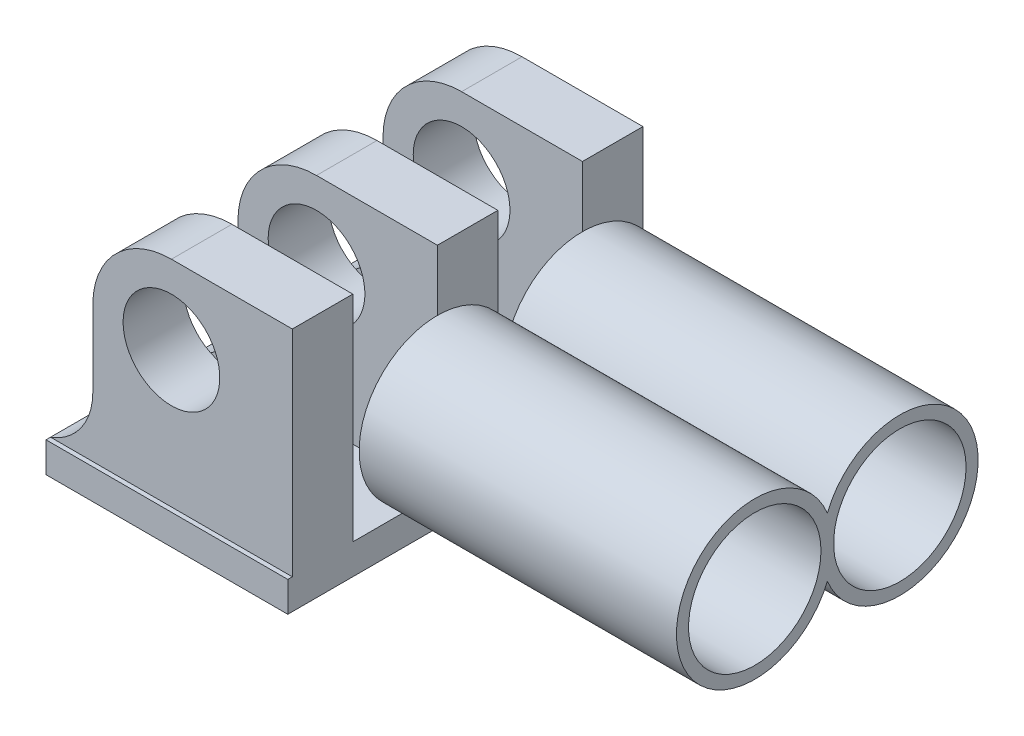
ISO-10303-21;
HEADER;
FILE_DESCRIPTION(('STEP AP214'),'2;1');
FILE_NAME('part.step','',(''),(''),'','','');
FILE_SCHEMA(('AUTOMOTIVE_DESIGN { 1 0 10303 214 1 1 1 1 }'));
ENDSEC;
DATA;
#1=APPLICATION_CONTEXT('core data for automotive mechanical design processes');
#2=APPLICATION_PROTOCOL_DEFINITION('international standard','automotive_design',2000,#1);
#3=PRODUCT_CONTEXT('',#1,'mechanical');
#4=PRODUCT('Part','Part','',(#3));
#5=PRODUCT_RELATED_PRODUCT_CATEGORY('part','',(#4));
#6=PRODUCT_DEFINITION_FORMATION('','',#4);
#7=PRODUCT_DEFINITION_CONTEXT('part definition',#1,'design');
#8=PRODUCT_DEFINITION('design','',#6,#7);
#9=PRODUCT_DEFINITION_SHAPE('','',#8);
#10=(LENGTH_UNIT() NAMED_UNIT(*) SI_UNIT(.MILLI.,.METRE.));
#11=(NAMED_UNIT(*) PLANE_ANGLE_UNIT() SI_UNIT($,.RADIAN.));
#12=(NAMED_UNIT(*) SI_UNIT($,.STERADIAN.) SOLID_ANGLE_UNIT());
#13=UNCERTAINTY_MEASURE_WITH_UNIT(LENGTH_MEASURE(1.E-05),#10,'distance_accuracy_value','');
#14=(GEOMETRIC_REPRESENTATION_CONTEXT(3) GLOBAL_UNCERTAINTY_ASSIGNED_CONTEXT((#13)) GLOBAL_UNIT_ASSIGNED_CONTEXT((#10,
#11,#12)) REPRESENTATION_CONTEXT('',''));
#15=CARTESIAN_POINT('',(0.,0.,0.));
#16=DIRECTION('',(0.,0.,1.));
#17=DIRECTION('',(1.,0.,0.));
#18=AXIS2_PLACEMENT_3D('',#15,#16,#17);
#19=CARTESIAN_POINT('',(209.55,57.15,38.735));
#20=DIRECTION('',(-1.,0.,0.));
#21=DIRECTION('',(0.,0.,1.));
#22=AXIS2_PLACEMENT_3D('',#19,#20,#21);
#23=CYLINDRICAL_SURFACE('',#22,27.8210988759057);
#24=CARTESIAN_POINT('',(209.55,57.15,38.735));
#25=DIRECTION('',(1.,0.,0.));
#26=DIRECTION('',(0.,0.,-1.));
#27=AXIS2_PLACEMENT_3D('',#24,#25,#26);
#28=CIRCLE('',#27,27.8210988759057);
#29=CARTESIAN_POINT('',(209.55,57.15,10.9139011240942));
#30=VERTEX_POINT('',#29);
#31=EDGE_CURVE('E142',#30,#30,#28,.T.);
#32=ORIENTED_EDGE('',*,*,#31,.T.);
#33=EDGE_LOOP('',(#32));
#34=FACE_BOUND('',#33,.T.);
#35=CARTESIAN_POINT('',(76.2,57.15,38.735));
#36=DIRECTION('',(1.,0.,0.));
#37=DIRECTION('',(0.,0.,-1.));
#38=AXIS2_PLACEMENT_3D('',#35,#36,#37);
#39=CIRCLE('',#38,27.8210988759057);
#40=CARTESIAN_POINT('',(76.2,57.15,10.9139011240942));
#41=VERTEX_POINT('',#40);
#42=EDGE_CURVE('E150',#41,#41,#39,.T.);
#43=ORIENTED_EDGE('',*,*,#42,.F.);
#44=EDGE_LOOP('',(#43));
#45=FACE_BOUND('',#44,.T.);
#46=ADVANCED_FACE('F112',(#34,#45),#23,.F.);
#47=CARTESIAN_POINT('',(209.55,57.15,38.735));
#48=DIRECTION('',(-1.,0.,0.));
#49=DIRECTION('',(0.,0.,1.));
#50=AXIS2_PLACEMENT_3D('',#47,#48,#49);
#51=CYLINDRICAL_SURFACE('',#50,32.9010988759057);
#52=CARTESIAN_POINT('',(76.2,57.15,38.735));
#53=DIRECTION('',(1.,0.,0.));
#54=DIRECTION('',(0.,0.,-1.));
#55=AXIS2_PLACEMENT_3D('',#52,#53,#54);
#56=CIRCLE('',#55,32.9010988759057);
#57=CARTESIAN_POINT('',(76.2,69.5375706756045,8.2550000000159));
#58=VERTEX_POINT('',#57);
#59=CARTESIAN_POINT('',(76.2,44.7624293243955,8.2550000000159));
#60=VERTEX_POINT('',#59);
#61=EDGE_CURVE('E147',#58,#60,#56,.T.);
#62=ORIENTED_EDGE('',*,*,#61,.T.);
#63=DIRECTION('',(-1.,0.,0.));
#64=VECTOR('',#63,1.);
#65=CARTESIAN_POINT('',(209.55,44.7624293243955,8.2550000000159));
#66=LINE('',#65,#64);
#67=CARTESIAN_POINT('',(209.55,44.7624293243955,8.2550000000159));
#68=VERTEX_POINT('',#67);
#69=EDGE_CURVE('E122',#68,#60,#66,.T.);
#70=ORIENTED_EDGE('',*,*,#69,.F.);
#71=CARTESIAN_POINT('',(209.55,57.15,38.735));
#72=DIRECTION('',(1.,0.,0.));
#73=DIRECTION('',(0.,0.,-1.));
#74=AXIS2_PLACEMENT_3D('',#71,#72,#73);
#75=CIRCLE('',#74,32.9010988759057);
#76=CARTESIAN_POINT('',(209.55,69.5375706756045,8.2550000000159));
#77=VERTEX_POINT('',#76);
#78=EDGE_CURVE('E153',#77,#68,#75,.T.);
#79=ORIENTED_EDGE('',*,*,#78,.F.);
#80=DIRECTION('',(-1.,0.,0.));
#81=VECTOR('',#80,1.);
#82=CARTESIAN_POINT('',(209.55,69.5375706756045,8.2550000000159));
#83=LINE('',#82,#81);
#84=EDGE_CURVE('E13',#77,#58,#83,.T.);
#85=ORIENTED_EDGE('',*,*,#84,.T.);
#86=EDGE_LOOP('',(#62,#70,#79,#85));
#87=FACE_BOUND('',#86,.T.);
#88=ADVANCED_FACE('F149',(#87),#51,.T.);
#89=CARTESIAN_POINT('',(76.2,0.,0.));
#90=DIRECTION('',(1.,0.,0.));
#91=DIRECTION('',(0.,0.,-1.));
#92=AXIS2_PLACEMENT_3D('',#89,#90,#91);
#93=PLANE('',#92);
#94=ORIENTED_EDGE('',*,*,#61,.F.);
#95=CARTESIAN_POINT('',(76.2,57.15,-22.2249999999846));
#96=DIRECTION('',(1.,0.,0.));
#97=DIRECTION('',(0.,0.,-1.));
#98=AXIS2_PLACEMENT_3D('',#95,#96,#97);
#99=CIRCLE('',#98,32.9010988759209);
#100=EDGE_CURVE('E116',#60,#58,#99,.T.);
#101=ORIENTED_EDGE('',*,*,#100,.F.);
#102=EDGE_LOOP('',(#94,#101));
#103=FACE_BOUND('',#102,.T.);
#104=ORIENTED_EDGE('',*,*,#42,.T.);
#105=EDGE_LOOP('',(#104));
#106=FACE_BOUND('',#105,.T.);
#107=CARTESIAN_POINT('',(76.2,57.15,-22.2249999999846));
#108=DIRECTION('',(1.,0.,0.));
#109=DIRECTION('',(0.,0.,-1.));
#110=AXIS2_PLACEMENT_3D('',#107,#108,#109);
#111=CIRCLE('',#110,27.821098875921);
#112=CARTESIAN_POINT('',(76.2,57.15,-50.0460988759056));
#113=VERTEX_POINT('',#112);
#114=EDGE_CURVE('E160',#113,#113,#111,.T.);
#115=ORIENTED_EDGE('',*,*,#114,.T.);
#116=EDGE_LOOP('',(#115));
#117=FACE_BOUND('',#116,.T.);
#118=ADVANCED_FACE('F145',(#103,#106,#117),#93,.F.);
#119=CARTESIAN_POINT('',(209.55,0.,0.));
#120=DIRECTION('',(1.,0.,0.));
#121=DIRECTION('',(0.,0.,-1.));
#122=AXIS2_PLACEMENT_3D('',#119,#120,#121);
#123=PLANE('',#122);
#124=ORIENTED_EDGE('',*,*,#78,.T.);
#125=CARTESIAN_POINT('',(209.55,57.15,-22.2249999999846));
#126=DIRECTION('',(1.,0.,0.));
#127=DIRECTION('',(0.,0.,-1.));
#128=AXIS2_PLACEMENT_3D('',#125,#126,#127);
#129=CIRCLE('',#128,32.9010988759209);
#130=EDGE_CURVE('E140',#68,#77,#129,.T.);
#131=ORIENTED_EDGE('',*,*,#130,.T.);
#132=EDGE_LOOP('',(#124,#131));
#133=FACE_BOUND('',#132,.T.);
#134=ORIENTED_EDGE('',*,*,#31,.F.);
#135=EDGE_LOOP('',(#134));
#136=FACE_BOUND('',#135,.T.);
#137=CARTESIAN_POINT('',(209.55,57.15,-22.2249999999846));
#138=DIRECTION('',(1.,0.,0.));
#139=DIRECTION('',(0.,0.,-1.));
#140=AXIS2_PLACEMENT_3D('',#137,#138,#139);
#141=CIRCLE('',#140,27.821098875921);
#142=CARTESIAN_POINT('',(209.55,57.15,-50.0460988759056));
#143=VERTEX_POINT('',#142);
#144=EDGE_CURVE('E148',#143,#143,#141,.T.);
#145=ORIENTED_EDGE('',*,*,#144,.F.);
#146=EDGE_LOOP('',(#145));
#147=FACE_BOUND('',#146,.T.);
#148=ADVANCED_FACE('F167',(#133,#136,#147),#123,.T.);
#149=CARTESIAN_POINT('',(209.55,57.15,-22.2249999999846));
#150=DIRECTION('',(-1.,0.,0.));
#151=DIRECTION('',(0.,0.,1.));
#152=AXIS2_PLACEMENT_3D('',#149,#150,#151);
#153=CYLINDRICAL_SURFACE('',#152,27.821098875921);
#154=ORIENTED_EDGE('',*,*,#144,.T.);
#155=EDGE_LOOP('',(#154));
#156=FACE_BOUND('',#155,.T.);
#157=ORIENTED_EDGE('',*,*,#114,.F.);
#158=EDGE_LOOP('',(#157));
#159=FACE_BOUND('',#158,.T.);
#160=ADVANCED_FACE('F165',(#156,#159),#153,.F.);
#161=CARTESIAN_POINT('',(209.55,57.15,-22.2249999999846));
#162=DIRECTION('',(-1.,0.,0.));
#163=DIRECTION('',(0.,0.,1.));
#164=AXIS2_PLACEMENT_3D('',#161,#162,#163);
#165=CYLINDRICAL_SURFACE('',#164,32.9010988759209);
#166=ORIENTED_EDGE('',*,*,#130,.F.);
#167=ORIENTED_EDGE('',*,*,#69,.T.);
#168=ORIENTED_EDGE('',*,*,#100,.T.);
#169=ORIENTED_EDGE('',*,*,#84,.F.);
#170=EDGE_LOOP('',(#166,#167,#168,#169));
#171=FACE_BOUND('',#170,.T.);
#172=ADVANCED_FACE('F114',(#171),#165,.T.);
#173=CLOSED_SHELL('',(#46,#88,#118,#148,#160,#172));
#174=MANIFOLD_SOLID_BREP('B2',#173);
#175=CARTESIAN_POINT('',(0.,0.,0.));
#176=DIRECTION('',(0.,1.,0.));
#177=DIRECTION('',(0.,0.,1.));
#178=AXIS2_PLACEMENT_3D('',#175,#176,#177);
#179=PLANE('',#178);
#180=DIRECTION('',(0.,0.,-1.));
#181=VECTOR('',#180,1.);
#182=CARTESIAN_POINT('',(50.8,0.,76.2));
#183=LINE('',#182,#181);
#184=CARTESIAN_POINT('',(50.8,0.,76.2));
#185=VERTEX_POINT('',#184);
#186=CARTESIAN_POINT('',(50.8,0.,74.2949999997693));
#187=VERTEX_POINT('',#186);
#188=EDGE_CURVE('E269',#185,#187,#183,.T.);
#189=ORIENTED_EDGE('',*,*,#188,.T.);
#190=DIRECTION('',(1.,0.,0.));
#191=VECTOR('',#190,1.);
#192=CARTESIAN_POINT('',(-400007.039347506,0.,74.2950000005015));
#193=LINE('',#192,#191);
#194=CARTESIAN_POINT('',(-50.8,0.,74.2949999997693));
#195=VERTEX_POINT('',#194);
#196=EDGE_CURVE('E446',#195,#187,#193,.T.);
#197=ORIENTED_EDGE('',*,*,#196,.F.);
#198=DIRECTION('',(0.,0.,1.));
#199=VECTOR('',#198,1.);
#200=CARTESIAN_POINT('',(-50.8,0.,76.2));
#201=LINE('',#200,#199);
#202=CARTESIAN_POINT('',(-50.8,0.,76.2));
#203=VERTEX_POINT('',#202);
#204=EDGE_CURVE('E554',#195,#203,#201,.T.);
#205=ORIENTED_EDGE('',*,*,#204,.T.);
#206=DIRECTION('',(1.,0.,0.));
#207=VECTOR('',#206,1.);
#208=CARTESIAN_POINT('',(50.8,0.,76.2));
#209=LINE('',#208,#207);
#210=EDGE_CURVE('E573',#203,#185,#209,.T.);
#211=ORIENTED_EDGE('',*,*,#210,.T.);
#212=EDGE_LOOP('',(#189,#197,#205,#211));
#213=FACE_BOUND('',#212,.T.);
#214=ADVANCED_FACE('F244',(#213),#179,.T.);
#215=CARTESIAN_POINT('',(-50.8,0.,-76.2));
#216=VERTEX_POINT('',#215);
#217=CARTESIAN_POINT('',(-50.8,0.,-73.024999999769));
#218=VERTEX_POINT('',#217);
#219=EDGE_CURVE('E570',#216,#218,#201,.T.);
#220=ORIENTED_EDGE('',*,*,#219,.T.);
#221=DIRECTION('',(1.,0.,0.));
#222=VECTOR('',#221,1.);
#223=CARTESIAN_POINT('',(400007.039347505,0.,-73.0250000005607));
#224=LINE('',#223,#222);
#225=CARTESIAN_POINT('',(50.7999999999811,0.,-73.0249999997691));
#226=VERTEX_POINT('',#225);
#227=EDGE_CURVE('E459',#218,#226,#224,.T.);
#228=ORIENTED_EDGE('',*,*,#227,.T.);
#229=CARTESIAN_POINT('',(50.8,0.,-76.2));
#230=VERTEX_POINT('',#229);
#231=EDGE_CURVE('E577',#226,#230,#183,.T.);
#232=ORIENTED_EDGE('',*,*,#231,.T.);
#233=DIRECTION('',(-1.,0.,0.));
#234=VECTOR('',#233,1.);
#235=CARTESIAN_POINT('',(50.8,0.,-76.2));
#236=LINE('',#235,#234);
#237=EDGE_CURVE('E561',#230,#216,#236,.T.);
#238=ORIENTED_EDGE('',*,*,#237,.T.);
#239=EDGE_LOOP('',(#220,#228,#232,#238));
#240=FACE_BOUND('',#239,.T.);
#241=ADVANCED_FACE('F631',(#240),#179,.T.);
#242=DIRECTION('',(-1.,0.,0.));
#243=VECTOR('',#242,1.);
#244=CARTESIAN_POINT('',(400007.039347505,0.,-47.6250000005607));
#245=LINE('',#244,#243);
#246=CARTESIAN_POINT('',(50.8,0.,-47.6249999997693));
#247=VERTEX_POINT('',#246);
#248=CARTESIAN_POINT('',(-50.8,0.,-47.624999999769));
#249=VERTEX_POINT('',#248);
#250=EDGE_CURVE('E488',#247,#249,#245,.T.);
#251=ORIENTED_EDGE('',*,*,#250,.T.);
#252=CARTESIAN_POINT('',(-50.8,0.,-12.0649999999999));
#253=VERTEX_POINT('',#252);
#254=EDGE_CURVE('E574',#249,#253,#201,.T.);
#255=ORIENTED_EDGE('',*,*,#254,.T.);
#256=DIRECTION('',(1.,0.,0.));
#257=VECTOR('',#256,1.);
#258=CARTESIAN_POINT('',(-50.7999999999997,0.,-12.0649999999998));
#259=LINE('',#258,#257);
#260=CARTESIAN_POINT('',(50.8,0.,-12.0649999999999));
#261=VERTEX_POINT('',#260);
#262=EDGE_CURVE('E487',#253,#261,#259,.T.);
#263=ORIENTED_EDGE('',*,*,#262,.T.);
#264=EDGE_CURVE('E580',#261,#247,#183,.T.);
#265=ORIENTED_EDGE('',*,*,#264,.T.);
#266=EDGE_LOOP('',(#251,#255,#263,#265));
#267=FACE_BOUND('',#266,.T.);
#268=ADVANCED_FACE('F596',(#267),#179,.T.);
#269=CARTESIAN_POINT('',(-50.8,-12.7,76.2));
#270=DIRECTION('',(-1.,0.,0.));
#271=DIRECTION('',(0.,0.,1.));
#272=AXIS2_PLACEMENT_3D('',#269,#270,#271);
#273=PLANE('',#272);
#274=ORIENTED_EDGE('',*,*,#219,.F.);
#275=DIRECTION('',(0.,1.,0.));
#276=VECTOR('',#275,1.);
#277=CARTESIAN_POINT('',(-50.8,-12.7,-76.2));
#278=LINE('',#277,#276);
#279=CARTESIAN_POINT('',(-50.8,-12.7,-76.2));
#280=VERTEX_POINT('',#279);
#281=EDGE_CURVE('E110',#280,#216,#278,.T.);
#282=ORIENTED_EDGE('',*,*,#281,.F.);
#283=DIRECTION('',(0.,0.,1.));
#284=VECTOR('',#283,1.);
#285=CARTESIAN_POINT('',(-50.8,-12.7,76.2));
#286=LINE('',#285,#284);
#287=CARTESIAN_POINT('',(-50.8,-12.7,76.2));
#288=VERTEX_POINT('',#287);
#289=EDGE_CURVE('E557',#280,#288,#286,.T.);
#290=ORIENTED_EDGE('',*,*,#289,.T.);
#291=DIRECTION('',(0.,1.,0.));
#292=VECTOR('',#291,1.);
#293=CARTESIAN_POINT('',(-50.8,-12.7,76.2));
#294=LINE('',#293,#292);
#295=EDGE_CURVE('E248',#288,#203,#294,.T.);
#296=ORIENTED_EDGE('',*,*,#295,.T.);
#297=ORIENTED_EDGE('',*,*,#204,.F.);
#298=DIRECTION('',(0.,0.,-1.));
#299=VECTOR('',#298,1.);
#300=CARTESIAN_POINT('',(-50.8000000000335,-1.22020449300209E-11,210.137515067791));
#301=LINE('',#300,#299);
#302=CARTESIAN_POINT('',(-50.8000000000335,-1.22020449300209E-11,48.8949999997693));
#303=VERTEX_POINT('',#302);
#304=EDGE_CURVE('E406',#195,#303,#301,.T.);
#305=ORIENTED_EDGE('',*,*,#304,.T.);
#306=CARTESIAN_POINT('',(-50.8,0.,13.3350000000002));
#307=VERTEX_POINT('',#306);
#308=EDGE_CURVE('E575',#307,#303,#201,.T.);
#309=ORIENTED_EDGE('',*,*,#308,.F.);
#310=DIRECTION('',(0.,0.,-1.));
#311=VECTOR('',#310,1.);
#312=CARTESIAN_POINT('',(-50.8,0.,149.177515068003));
#313=LINE('',#312,#311);
#314=EDGE_CURVE('E543',#307,#253,#313,.T.);
#315=ORIENTED_EDGE('',*,*,#314,.T.);
#316=ORIENTED_EDGE('',*,*,#254,.F.);
#317=DIRECTION('',(0.,0.,-1.));
#318=VECTOR('',#317,1.);
#319=CARTESIAN_POINT('',(-50.8000000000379,0.,88.217515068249));
#320=LINE('',#319,#318);
#321=EDGE_CURVE('E490',#249,#218,#320,.T.);
#322=ORIENTED_EDGE('',*,*,#321,.T.);
#323=EDGE_LOOP('',(#274,#282,#290,#296,#297,#305,#309,#315,#316,#322));
#324=FACE_BOUND('',#323,.T.);
#325=ADVANCED_FACE('F246',(#324),#273,.T.);
#326=CARTESIAN_POINT('',(50.8,-12.7,-76.2));
#327=DIRECTION('',(0.,0.,-1.));
#328=DIRECTION('',(-1.,0.,0.));
#329=AXIS2_PLACEMENT_3D('',#326,#327,#328);
#330=PLANE('',#329);
#331=ORIENTED_EDGE('',*,*,#237,.F.);
#332=DIRECTION('',(0.,1.,0.));
#333=VECTOR('',#332,1.);
#334=CARTESIAN_POINT('',(50.8,-12.7,-76.2));
#335=LINE('',#334,#333);
#336=CARTESIAN_POINT('',(50.8,-12.7,-76.2));
#337=VERTEX_POINT('',#336);
#338=EDGE_CURVE('E253',#337,#230,#335,.T.);
#339=ORIENTED_EDGE('',*,*,#338,.F.);
#340=DIRECTION('',(-1.,0.,0.));
#341=VECTOR('',#340,1.);
#342=CARTESIAN_POINT('',(50.8,-12.7,-76.2));
#343=LINE('',#342,#341);
#344=EDGE_CURVE('E567',#337,#280,#343,.T.);
#345=ORIENTED_EDGE('',*,*,#344,.T.);
#346=ORIENTED_EDGE('',*,*,#281,.T.);
#347=EDGE_LOOP('',(#331,#339,#345,#346));
#348=FACE_BOUND('',#347,.T.);
#349=ADVANCED_FACE('F638',(#348),#330,.T.);
#350=CARTESIAN_POINT('',(50.8,-12.7,76.2));
#351=DIRECTION('',(1.,0.,0.));
#352=DIRECTION('',(0.,0.,-1.));
#353=AXIS2_PLACEMENT_3D('',#350,#351,#352);
#354=PLANE('',#353);
#355=ORIENTED_EDGE('',*,*,#188,.F.);
#356=DIRECTION('',(0.,1.,0.));
#357=VECTOR('',#356,1.);
#358=CARTESIAN_POINT('',(50.8,-12.7,76.2));
#359=LINE('',#358,#357);
#360=CARTESIAN_POINT('',(50.8,-12.7,76.2));
#361=VERTEX_POINT('',#360);
#362=EDGE_CURVE('E584',#361,#185,#359,.T.);
#363=ORIENTED_EDGE('',*,*,#362,.F.);
#364=DIRECTION('',(0.,0.,-1.));
#365=VECTOR('',#364,1.);
#366=CARTESIAN_POINT('',(50.8,-12.7,76.2));
#367=LINE('',#366,#365);
#368=EDGE_CURVE('E564',#361,#337,#367,.T.);
#369=ORIENTED_EDGE('',*,*,#368,.T.);
#370=ORIENTED_EDGE('',*,*,#338,.T.);
#371=ORIENTED_EDGE('',*,*,#231,.F.);
#372=DIRECTION('',(0.,1.,0.));
#373=VECTOR('',#372,1.);
#374=CARTESIAN_POINT('',(50.7999999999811,-291514.503972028,-73.0249999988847));
#375=LINE('',#374,#373);
#376=CARTESIAN_POINT('',(50.7999999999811,90.1700000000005,-73.0249999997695));
#377=VERTEX_POINT('',#376);
#378=EDGE_CURVE('E468',#226,#377,#375,.T.);
#379=ORIENTED_EDGE('',*,*,#378,.T.);
#380=DIRECTION('',(0.,0.,-1.));
#381=VECTOR('',#380,1.);
#382=CARTESIAN_POINT('',(50.7999999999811,90.170000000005,88.217515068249));
#383=LINE('',#382,#381);
#384=CARTESIAN_POINT('',(50.7999999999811,90.170000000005,-47.6249999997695));
#385=VERTEX_POINT('',#384);
#386=EDGE_CURVE('E497',#385,#377,#383,.T.);
#387=ORIENTED_EDGE('',*,*,#386,.F.);
#388=DIRECTION('',(0.,-1.,0.));
#389=VECTOR('',#388,1.);
#390=CARTESIAN_POINT('',(50.7999999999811,-291514.503972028,-47.6249999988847));
#391=LINE('',#390,#389);
#392=EDGE_CURVE('E491',#385,#247,#391,.T.);
#393=ORIENTED_EDGE('',*,*,#392,.T.);
#394=ORIENTED_EDGE('',*,*,#264,.F.);
#395=DIRECTION('',(0.,-1.,0.));
#396=VECTOR('',#395,1.);
#397=CARTESIAN_POINT('',(50.8,90.1700000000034,-12.0650000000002));
#398=LINE('',#397,#396);
#399=CARTESIAN_POINT('',(50.8,90.170000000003,-12.0650000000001));
#400=VERTEX_POINT('',#399);
#401=EDGE_CURVE('E510',#400,#261,#398,.T.);
#402=ORIENTED_EDGE('',*,*,#401,.F.);
#403=DIRECTION('',(0.,0.,-1.));
#404=VECTOR('',#403,1.);
#405=CARTESIAN_POINT('',(50.8,90.170000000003,149.177515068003));
#406=LINE('',#405,#404);
#407=CARTESIAN_POINT('',(50.8,90.170000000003,13.3349999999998));
#408=VERTEX_POINT('',#407);
#409=EDGE_CURVE('E552',#408,#400,#406,.T.);
#410=ORIENTED_EDGE('',*,*,#409,.F.);
#411=DIRECTION('',(0.,-1.,0.));
#412=VECTOR('',#411,1.);
#413=CARTESIAN_POINT('',(50.8,90.1700000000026,13.3349999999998));
#414=LINE('',#413,#412);
#415=CARTESIAN_POINT('',(50.8,0.,13.3349999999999));
#416=VERTEX_POINT('',#415);
#417=EDGE_CURVE('E537',#408,#416,#414,.T.);
#418=ORIENTED_EDGE('',*,*,#417,.T.);
#419=CARTESIAN_POINT('',(50.8,0.,48.8949999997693));
#420=VERTEX_POINT('',#419);
#421=EDGE_CURVE('E579',#420,#416,#183,.T.);
#422=ORIENTED_EDGE('',*,*,#421,.F.);
#423=DIRECTION('',(0.,-1.,0.));
#424=VECTOR('',#423,1.);
#425=CARTESIAN_POINT('',(50.7999999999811,-291514.104461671,48.8950000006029));
#426=LINE('',#425,#424);
#427=CARTESIAN_POINT('',(50.7999999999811,90.1700000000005,48.8949999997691));
#428=VERTEX_POINT('',#427);
#429=EDGE_CURVE('E422',#428,#420,#426,.T.);
#430=ORIENTED_EDGE('',*,*,#429,.F.);
#431=DIRECTION('',(0.,0.,-1.));
#432=VECTOR('',#431,1.);
#433=CARTESIAN_POINT('',(50.7999999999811,90.1700000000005,210.137515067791));
#434=LINE('',#433,#432);
#435=CARTESIAN_POINT('',(50.7999999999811,90.1700000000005,74.294999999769));
#436=VERTEX_POINT('',#435);
#437=EDGE_CURVE('E436',#436,#428,#434,.T.);
#438=ORIENTED_EDGE('',*,*,#437,.F.);
#439=DIRECTION('',(0.,1.,0.));
#440=VECTOR('',#439,1.);
#441=CARTESIAN_POINT('',(50.7999999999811,-291514.104461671,74.2950000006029));
#442=LINE('',#441,#440);
#443=EDGE_CURVE('E448',#187,#436,#442,.T.);
#444=ORIENTED_EDGE('',*,*,#443,.F.);
#445=EDGE_LOOP('',(#355,#363,#369,#370,#371,#379,#387,#393,#394,#402,#410,#418,#422,#430,#438,#444));
#446=FACE_BOUND('',#445,.T.);
#447=ADVANCED_FACE('F628',(#446),#354,.T.);
#448=CARTESIAN_POINT('',(50.8,-12.7,76.2));
#449=DIRECTION('',(0.,0.,1.));
#450=DIRECTION('',(1.,0.,0.));
#451=AXIS2_PLACEMENT_3D('',#448,#449,#450);
#452=PLANE('',#451);
#453=ORIENTED_EDGE('',*,*,#210,.F.);
#454=ORIENTED_EDGE('',*,*,#295,.F.);
#455=DIRECTION('',(1.,0.,0.));
#456=VECTOR('',#455,1.);
#457=CARTESIAN_POINT('',(50.8,-12.7,76.2));
#458=LINE('',#457,#456);
#459=EDGE_CURVE('E560',#288,#361,#458,.T.);
#460=ORIENTED_EDGE('',*,*,#459,.T.);
#461=ORIENTED_EDGE('',*,*,#362,.T.);
#462=EDGE_LOOP('',(#453,#454,#460,#461));
#463=FACE_BOUND('',#462,.T.);
#464=ADVANCED_FACE('F593',(#463),#452,.T.);
#465=CARTESIAN_POINT('',(0.,-12.7,0.));
#466=DIRECTION('',(0.,1.,0.));
#467=DIRECTION('',(0.,0.,1.));
#468=AXIS2_PLACEMENT_3D('',#465,#466,#467);
#469=PLANE('',#468);
#470=ORIENTED_EDGE('',*,*,#289,.F.);
#471=ORIENTED_EDGE('',*,*,#344,.F.);
#472=ORIENTED_EDGE('',*,*,#368,.F.);
#473=ORIENTED_EDGE('',*,*,#459,.F.);
#474=EDGE_LOOP('',(#470,#471,#472,#473));
#475=FACE_BOUND('',#474,.T.);
#476=ADVANCED_FACE('F682',(#475),#469,.F.);
#477=DIRECTION('',(-1.,0.,0.));
#478=VECTOR('',#477,1.);
#479=CARTESIAN_POINT('',(-400007.039347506,0.,48.8950000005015));
#480=LINE('',#479,#478);
#481=EDGE_CURVE('E261',#420,#303,#480,.T.);
#482=ORIENTED_EDGE('',*,*,#481,.F.);
#483=ORIENTED_EDGE('',*,*,#421,.T.);
#484=DIRECTION('',(1.,0.,0.));
#485=VECTOR('',#484,1.);
#486=CARTESIAN_POINT('',(-50.8000000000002,0.,13.3350000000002));
#487=LINE('',#486,#485);
#488=EDGE_CURVE('E540',#307,#416,#487,.T.);
#489=ORIENTED_EDGE('',*,*,#488,.F.);
#490=ORIENTED_EDGE('',*,*,#308,.T.);
#491=EDGE_LOOP('',(#482,#483,#489,#490));
#492=FACE_BOUND('',#491,.T.);
#493=ADVANCED_FACE('F611',(#492),#179,.T.);
#494=CARTESIAN_POINT('',(-60.0528571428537,25.3999999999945,149.177515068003));
#495=DIRECTION('',(0.,0.,-1.));
#496=DIRECTION('',(-1.,0.,0.));
#497=AXIS2_PLACEMENT_3D('',#494,#495,#496);
#498=CYLINDRICAL_SURFACE('',#497,27.0328571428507);
#499=CARTESIAN_POINT('',(-60.0528571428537,25.3999999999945,13.3350000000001));
#500=DIRECTION('',(0.,0.,1.));
#501=DIRECTION('',(0.,-1.,0.));
#502=AXIS2_PLACEMENT_3D('',#499,#500,#501);
#503=CIRCLE('',#502,27.0328571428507);
#504=CARTESIAN_POINT('',(-33.020000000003,25.3999999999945,13.3350000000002));
#505=VERTEX_POINT('',#504);
#506=EDGE_CURVE('E526',#505,#307,#503,.F.);
#507=ORIENTED_EDGE('',*,*,#506,.F.);
#508=DIRECTION('',(0.,0.,-1.));
#509=VECTOR('',#508,1.);
#510=CARTESIAN_POINT('',(-33.020000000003,25.3999999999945,149.177515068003));
#511=LINE('',#510,#509);
#512=CARTESIAN_POINT('',(-33.020000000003,25.3999999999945,-12.0649999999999));
#513=VERTEX_POINT('',#512);
#514=EDGE_CURVE('E546',#505,#513,#511,.T.);
#515=ORIENTED_EDGE('',*,*,#514,.T.);
#516=CARTESIAN_POINT('',(-60.0528571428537,25.3999999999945,-12.0649999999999));
#517=DIRECTION('',(0.,0.,-1.));
#518=DIRECTION('',(0.,1.,0.));
#519=AXIS2_PLACEMENT_3D('',#516,#517,#518);
#520=CIRCLE('',#519,27.0328571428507);
#521=EDGE_CURVE('E520',#513,#253,#520,.T.);
#522=ORIENTED_EDGE('',*,*,#521,.T.);
#523=ORIENTED_EDGE('',*,*,#314,.F.);
#524=EDGE_LOOP('',(#507,#515,#522,#523));
#525=FACE_BOUND('',#524,.T.);
#526=ADVANCED_FACE('F603',(#525),#498,.F.);
#527=CARTESIAN_POINT('',(-33.020000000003,57.15,149.177515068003));
#528=DIRECTION('',(1.,0.,0.));
#529=DIRECTION('',(0.,0.,-1.));
#530=AXIS2_PLACEMENT_3D('',#527,#528,#529);
#531=PLANE('',#530);
#532=DIRECTION('',(0.,-1.,0.));
#533=VECTOR('',#532,1.);
#534=CARTESIAN_POINT('',(-33.020000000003,57.1499999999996,13.335));
#535=LINE('',#534,#533);
#536=CARTESIAN_POINT('',(-33.020000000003,57.15,13.335));
#537=VERTEX_POINT('',#536);
#538=EDGE_CURVE('E529',#537,#505,#535,.T.);
#539=ORIENTED_EDGE('',*,*,#538,.F.);
#540=DIRECTION('',(0.,0.,-1.));
#541=VECTOR('',#540,1.);
#542=CARTESIAN_POINT('',(-33.020000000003,57.15,149.177515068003));
#543=LINE('',#542,#541);
#544=CARTESIAN_POINT('',(-33.020000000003,57.15,-12.0650000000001));
#545=VERTEX_POINT('',#544);
#546=EDGE_CURVE('E548',#537,#545,#543,.T.);
#547=ORIENTED_EDGE('',*,*,#546,.T.);
#548=DIRECTION('',(0.,-1.,0.));
#549=VECTOR('',#548,1.);
#550=CARTESIAN_POINT('',(-33.020000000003,57.1500000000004,-12.065));
#551=LINE('',#550,#549);
#552=EDGE_CURVE('E517',#545,#513,#551,.T.);
#553=ORIENTED_EDGE('',*,*,#552,.T.);
#554=ORIENTED_EDGE('',*,*,#514,.F.);
#555=EDGE_LOOP('',(#539,#547,#553,#554));
#556=FACE_BOUND('',#555,.T.);
#557=ADVANCED_FACE('F618',(#556),#531,.F.);
#558=CARTESIAN_POINT('',(0.,57.15,149.177515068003));
#559=DIRECTION('',(0.,0.,-1.));
#560=DIRECTION('',(-1.,0.,0.));
#561=AXIS2_PLACEMENT_3D('',#558,#559,#560);
#562=CYLINDRICAL_SURFACE('',#561,33.020000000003);
#563=CARTESIAN_POINT('',(0.,57.15,13.3349999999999));
#564=DIRECTION('',(0.,0.,1.));
#565=DIRECTION('',(0.,-1.,0.));
#566=AXIS2_PLACEMENT_3D('',#563,#564,#565);
#567=CIRCLE('',#566,33.020000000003);
#568=CARTESIAN_POINT('',(0.,90.170000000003,13.335));
#569=VERTEX_POINT('',#568);
#570=EDGE_CURVE('E532',#569,#537,#567,.T.);
#571=ORIENTED_EDGE('',*,*,#570,.F.);
#572=DIRECTION('',(0.,0.,-1.));
#573=VECTOR('',#572,1.);
#574=CARTESIAN_POINT('',(0.,90.170000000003,149.177515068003));
#575=LINE('',#574,#573);
#576=CARTESIAN_POINT('',(0.,90.170000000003,-12.0650000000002));
#577=VERTEX_POINT('',#576);
#578=EDGE_CURVE('E550',#569,#577,#575,.T.);
#579=ORIENTED_EDGE('',*,*,#578,.T.);
#580=CARTESIAN_POINT('',(0.,57.15,-12.065));
#581=DIRECTION('',(0.,0.,-1.));
#582=DIRECTION('',(0.,1.,0.));
#583=AXIS2_PLACEMENT_3D('',#580,#581,#582);
#584=CIRCLE('',#583,33.020000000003);
#585=EDGE_CURVE('E514',#577,#545,#584,.F.);
#586=ORIENTED_EDGE('',*,*,#585,.T.);
#587=ORIENTED_EDGE('',*,*,#546,.F.);
#588=EDGE_LOOP('',(#571,#579,#586,#587));
#589=FACE_BOUND('',#588,.T.);
#590=ADVANCED_FACE('F620',(#589),#562,.T.);
#591=CARTESIAN_POINT('',(0.,90.170000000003,149.177515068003));
#592=DIRECTION('',(0.,1.,0.));
#593=DIRECTION('',(-1.,0.,0.));
#594=AXIS2_PLACEMENT_3D('',#591,#592,#593);
#595=PLANE('',#594);
#596=ORIENTED_EDGE('',*,*,#578,.F.);
#597=DIRECTION('',(1.,0.,0.));
#598=VECTOR('',#597,1.);
#599=CARTESIAN_POINT('',(-2.28489422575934E-13,90.170000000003,13.3349999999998));
#600=LINE('',#599,#598);
#601=EDGE_CURVE('E535',#569,#408,#600,.T.);
#602=ORIENTED_EDGE('',*,*,#601,.T.);
#603=ORIENTED_EDGE('',*,*,#409,.T.);
#604=DIRECTION('',(1.,0.,0.));
#605=VECTOR('',#604,1.);
#606=CARTESIAN_POINT('',(2.48652937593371E-13,90.170000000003,-12.0650000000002));
#607=LINE('',#606,#605);
#608=EDGE_CURVE('E511',#577,#400,#607,.T.);
#609=ORIENTED_EDGE('',*,*,#608,.F.);
#610=EDGE_LOOP('',(#596,#602,#603,#609));
#611=FACE_BOUND('',#610,.T.);
#612=ADVANCED_FACE('F625',(#611),#595,.T.);
#613=CARTESIAN_POINT('',(0.,57.15,149.177515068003));
#614=DIRECTION('',(0.,0.,-1.));
#615=DIRECTION('',(-1.,0.,0.));
#616=AXIS2_PLACEMENT_3D('',#613,#614,#615);
#617=CYLINDRICAL_SURFACE('',#616,20.3199999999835);
#618=CARTESIAN_POINT('',(0.,57.15,13.3349999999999));
#619=DIRECTION('',(0.,0.,1.));
#620=DIRECTION('',(0.,-1.,0.));
#621=AXIS2_PLACEMENT_3D('',#618,#619,#620);
#622=CIRCLE('',#621,20.3199999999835);
#623=CARTESIAN_POINT('',(-20.3199999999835,57.15,13.335));
#624=VERTEX_POINT('',#623);
#625=EDGE_CURVE('E509',#624,#624,#622,.T.);
#626=CARTESIAN_POINT('',(0.,57.15,-12.065));
#627=DIRECTION('',(0.,0.,-1.));
#628=DIRECTION('',(0.,1.,0.));
#629=AXIS2_PLACEMENT_3D('',#626,#627,#628);
#630=CIRCLE('',#629,20.3199999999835);
#631=CARTESIAN_POINT('',(-20.3199999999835,57.15,-12.065));
#632=VERTEX_POINT('',#631);
#633=EDGE_CURVE('E506',#632,#632,#630,.F.);
#634=CARTESIAN_POINT('',(-20.3199999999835,57.15,13.335));
#635=CARTESIAN_POINT('',(-20.3199999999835,57.15,13.0704166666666));
#636=CARTESIAN_POINT('',(-20.3199999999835,57.15,12.8058333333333));
#637=CARTESIAN_POINT('',(-20.3199999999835,57.15,12.2766666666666));
#638=CARTESIAN_POINT('',(-20.3199999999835,57.15,12.0120833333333));
#639=CARTESIAN_POINT('',(-20.3199999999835,57.15,11.4829166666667));
#640=CARTESIAN_POINT('',(-20.3199999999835,57.15,11.2183333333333));
#641=CARTESIAN_POINT('',(-20.3199999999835,57.15,10.6891666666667));
#642=CARTESIAN_POINT('',(-20.3199999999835,57.15,10.4245833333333));
#643=CARTESIAN_POINT('',(-20.3199999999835,57.15,9.89541666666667));
#644=CARTESIAN_POINT('',(-20.3199999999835,57.15,9.63083333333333));
#645=CARTESIAN_POINT('',(-20.3199999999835,57.15,9.10166666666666));
#646=CARTESIAN_POINT('',(-20.3199999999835,57.15,8.83708333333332));
#647=CARTESIAN_POINT('',(-20.3199999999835,57.15,8.30791666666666));
#648=CARTESIAN_POINT('',(-20.3199999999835,57.15,8.04333333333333));
#649=CARTESIAN_POINT('',(-20.3199999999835,57.15,7.51416666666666));
#650=CARTESIAN_POINT('',(-20.3199999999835,57.15,7.24958333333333));
#651=CARTESIAN_POINT('',(-20.3199999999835,57.15,6.72041666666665));
#652=CARTESIAN_POINT('',(-20.3199999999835,57.15,6.45583333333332));
#653=CARTESIAN_POINT('',(-20.3199999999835,57.15,5.92666666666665));
#654=CARTESIAN_POINT('',(-20.3199999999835,57.15,5.66208333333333));
#655=CARTESIAN_POINT('',(-20.3199999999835,57.15,5.13291666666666));
#656=CARTESIAN_POINT('',(-20.3199999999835,57.15,4.86833333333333));
#657=CARTESIAN_POINT('',(-20.3199999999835,57.15,4.33916666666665));
#658=CARTESIAN_POINT('',(-20.3199999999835,57.15,4.07458333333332));
#659=CARTESIAN_POINT('',(-20.3199999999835,57.15,3.54541666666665));
#660=CARTESIAN_POINT('',(-20.3199999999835,57.15,3.28083333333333));
#661=CARTESIAN_POINT('',(-20.3199999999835,57.15,2.75166666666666));
#662=CARTESIAN_POINT('',(-20.3199999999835,57.15,2.48708333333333));
#663=CARTESIAN_POINT('',(-20.3199999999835,57.15,1.95791666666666));
#664=CARTESIAN_POINT('',(-20.3199999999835,57.15,1.69333333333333));
#665=CARTESIAN_POINT('',(-20.3199999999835,57.15,1.16416666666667));
#666=CARTESIAN_POINT('',(-20.3199999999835,57.15,0.899583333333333));
#667=CARTESIAN_POINT('',(-20.3199999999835,57.15,0.37041666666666));
#668=CARTESIAN_POINT('',(-20.3199999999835,57.15,0.105833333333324));
#669=CARTESIAN_POINT('',(-20.3199999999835,57.15,-0.42333333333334));
#670=CARTESIAN_POINT('',(-20.3199999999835,57.15,-0.687916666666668));
#671=CARTESIAN_POINT('',(-20.3199999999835,57.15,-1.21708333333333));
#672=CARTESIAN_POINT('',(-20.3199999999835,57.15,-1.48166666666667));
#673=CARTESIAN_POINT('',(-20.3199999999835,57.15,-2.01083333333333));
#674=CARTESIAN_POINT('',(-20.3199999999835,57.15,-2.27541666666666));
#675=CARTESIAN_POINT('',(-20.3199999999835,57.15,-2.80458333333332));
#676=CARTESIAN_POINT('',(-20.3199999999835,57.15,-3.06916666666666));
#677=CARTESIAN_POINT('',(-20.3199999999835,57.15,-3.59833333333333));
#678=CARTESIAN_POINT('',(-20.3199999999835,57.15,-3.86291666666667));
#679=CARTESIAN_POINT('',(-20.3199999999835,57.15,-4.39208333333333));
#680=CARTESIAN_POINT('',(-20.3199999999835,57.15,-4.65666666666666));
#681=CARTESIAN_POINT('',(-20.3199999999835,57.15,-5.18583333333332));
#682=CARTESIAN_POINT('',(-20.3199999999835,57.15,-5.45041666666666));
#683=CARTESIAN_POINT('',(-20.3199999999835,57.15,-5.97958333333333));
#684=CARTESIAN_POINT('',(-20.3199999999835,57.15,-6.24416666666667));
#685=CARTESIAN_POINT('',(-20.3199999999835,57.15,-6.77333333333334));
#686=CARTESIAN_POINT('',(-20.3199999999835,57.15,-7.03791666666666));
#687=CARTESIAN_POINT('',(-20.3199999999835,57.15,-7.56708333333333));
#688=CARTESIAN_POINT('',(-20.3199999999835,57.15,-7.83166666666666));
#689=CARTESIAN_POINT('',(-20.3199999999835,57.15,-8.36083333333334));
#690=CARTESIAN_POINT('',(-20.3199999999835,57.15,-8.62541666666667));
#691=CARTESIAN_POINT('',(-20.3199999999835,57.15,-9.15458333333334));
#692=CARTESIAN_POINT('',(-20.3199999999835,57.15,-9.41916666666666));
#693=CARTESIAN_POINT('',(-20.3199999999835,57.15,-9.94833333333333));
#694=CARTESIAN_POINT('',(-20.3199999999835,57.15,-10.2129166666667));
#695=CARTESIAN_POINT('',(-20.3199999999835,57.15,-10.7420833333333));
#696=CARTESIAN_POINT('',(-20.3199999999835,57.15,-11.0066666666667));
#697=CARTESIAN_POINT('',(-20.3199999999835,57.15,-11.5358333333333));
#698=CARTESIAN_POINT('',(-20.3199999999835,57.15,-11.8004166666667));
#699=CARTESIAN_POINT('',(-20.3199999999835,57.15,-12.065));
#700=B_SPLINE_CURVE_WITH_KNOTS('',3,(#634,#635,#636,#637,#638,#639,#640,#641,#642,#643,#644,
#645,#646,#647,#648,#649,#650,#651,#652,#653,#654,#655,#656,#657,#658,#659,#660,#661,#662,#663,
#664,#665,#666,#667,#668,#669,#670,#671,#672,#673,#674,#675,#676,#677,#678,#679,#680,#681,#682,
#683,#684,#685,#686,#687,#688,#689,#690,#691,#692,#693,#694,#695,#696,#697,#698,#699),
.UNSPECIFIED.,.F.,.F.,(4,2,2,2,2,2,2,2,2,2,2,2,2,2,2,2,2,2,2,2,2,2,2,2,2,2,2,2,2,2,2,2,4),(0.,
0.79375000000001,1.58749999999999,2.38125,3.17499999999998,3.96874999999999,4.7625,
5.55624999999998,6.34999999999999,7.14375,7.93749999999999,8.73125,9.52500000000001,10.31875,
11.1125,11.90625,12.7,13.49375,14.2875,15.08125,15.875,16.66875,17.4625,18.25625,19.05,19.84375,
20.6375,21.43125,22.225,23.01875,23.8125,24.60625,25.4),.UNSPECIFIED.);
#701=EDGE_CURVE('BSEAM746',#624,#632,#700,.T.);
#702=ORIENTED_EDGE('',*,*,#625,.T.);
#703=ORIENTED_EDGE('',*,*,#633,.F.);
#704=ORIENTED_EDGE('',*,*,#701,.T.);
#705=ORIENTED_EDGE('',*,*,#701,.F.);
#706=EDGE_LOOP('',(#702,#704,#703,#705));
#707=FACE_BOUND('',#706,.T.);
#708=ADVANCED_FACE('F746',(#707),#617,.F.);
#709=CARTESIAN_POINT('',(-8.88783537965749,57.3461689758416,13.335));
#710=DIRECTION('',(0.,0.,1.));
#711=DIRECTION('',(0.0220662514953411,0.999756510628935,0.));
#712=AXIS2_PLACEMENT_3D('',#709,#710,#711);
#713=PLANE('',#712);
#714=ORIENTED_EDGE('',*,*,#625,.F.);
#715=EDGE_LOOP('',(#714));
#716=FACE_BOUND('',#715,.T.);
#717=ORIENTED_EDGE('',*,*,#506,.T.);
#718=ORIENTED_EDGE('',*,*,#488,.T.);
#719=ORIENTED_EDGE('',*,*,#417,.F.);
#720=ORIENTED_EDGE('',*,*,#601,.F.);
#721=ORIENTED_EDGE('',*,*,#570,.T.);
#722=ORIENTED_EDGE('',*,*,#538,.T.);
#723=EDGE_LOOP('',(#717,#718,#719,#720,#721,#722));
#724=FACE_BOUND('',#723,.T.);
#725=ADVANCED_FACE('F614',(#716,#724),#713,.T.);
#726=CARTESIAN_POINT('',(8.88783537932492,56.9538310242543,-12.0650000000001));
#727=DIRECTION('',(0.,0.,-1.));
#728=DIRECTION('',(-0.022066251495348,-0.999756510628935,0.));
#729=AXIS2_PLACEMENT_3D('',#726,#727,#728);
#730=PLANE('',#729);
#731=ORIENTED_EDGE('',*,*,#262,.F.);
#732=ORIENTED_EDGE('',*,*,#521,.F.);
#733=ORIENTED_EDGE('',*,*,#552,.F.);
#734=ORIENTED_EDGE('',*,*,#585,.F.);
#735=ORIENTED_EDGE('',*,*,#608,.T.);
#736=ORIENTED_EDGE('',*,*,#401,.T.);
#737=EDGE_LOOP('',(#731,#732,#733,#734,#735,#736));
#738=FACE_BOUND('',#737,.T.);
#739=ORIENTED_EDGE('',*,*,#633,.T.);
#740=EDGE_LOOP('',(#739));
#741=FACE_BOUND('',#740,.T.);
#742=ADVANCED_FACE('F606',(#738,#741),#730,.T.);
#743=CARTESIAN_POINT('',(-60.0528571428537,25.3999999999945,88.217515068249));
#744=DIRECTION('',(0.,0.,-1.));
#745=DIRECTION('',(-1.,0.,0.));
#746=AXIS2_PLACEMENT_3D('',#743,#744,#745);
#747=CYLINDRICAL_SURFACE('',#746,27.0328571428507);
#748=CARTESIAN_POINT('',(-60.0528571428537,25.3999999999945,-47.6249999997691));
#749=DIRECTION('',(0.,0.,1.));
#750=DIRECTION('',(0.,-1.,0.));
#751=AXIS2_PLACEMENT_3D('',#748,#749,#750);
#752=CIRCLE('',#751,27.0328571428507);
#753=CARTESIAN_POINT('',(-33.0200000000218,25.3999999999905,-47.6249999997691));
#754=VERTEX_POINT('',#753);
#755=EDGE_CURVE('E479',#754,#249,#752,.F.);
#756=ORIENTED_EDGE('',*,*,#755,.F.);
#757=DIRECTION('',(0.,0.,-1.));
#758=VECTOR('',#757,1.);
#759=CARTESIAN_POINT('',(-33.0200000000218,25.3999999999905,88.217515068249));
#760=LINE('',#759,#758);
#761=CARTESIAN_POINT('',(-33.0200000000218,25.3999999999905,-73.0249999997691));
#762=VERTEX_POINT('',#761);
#763=EDGE_CURVE('E475',#754,#762,#760,.T.);
#764=ORIENTED_EDGE('',*,*,#763,.T.);
#765=CARTESIAN_POINT('',(-60.0528571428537,25.3999999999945,-73.0249999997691));
#766=DIRECTION('',(0.,0.,1.));
#767=DIRECTION('',(0.,-1.,0.));
#768=AXIS2_PLACEMENT_3D('',#765,#766,#767);
#769=CIRCLE('',#768,27.0328571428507);
#770=EDGE_CURVE('E455',#218,#762,#769,.T.);
#771=ORIENTED_EDGE('',*,*,#770,.F.);
#772=ORIENTED_EDGE('',*,*,#321,.F.);
#773=EDGE_LOOP('',(#756,#764,#771,#772));
#774=FACE_BOUND('',#773,.T.);
#775=ADVANCED_FACE('F648',(#774),#747,.F.);
#776=CARTESIAN_POINT('',(400007.039347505,90.1700000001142,88.217515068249));
#777=DIRECTION('',(0.,1.,0.));
#778=DIRECTION('',(-1.,0.,0.));
#779=AXIS2_PLACEMENT_3D('',#776,#777,#778);
#780=PLANE('',#779);
#781=DIRECTION('',(0.,0.,-1.));
#782=VECTOR('',#781,1.);
#783=CARTESIAN_POINT('',(0.,90.170000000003,88.217515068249));
#784=LINE('',#783,#782);
#785=CARTESIAN_POINT('',(0.,90.170000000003,-47.6249999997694));
#786=VERTEX_POINT('',#785);
#787=CARTESIAN_POINT('',(0.,90.1700000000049,-73.0249999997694));
#788=VERTEX_POINT('',#787);
#789=EDGE_CURVE('E484',#786,#788,#784,.T.);
#790=ORIENTED_EDGE('',*,*,#789,.F.);
#791=DIRECTION('',(1.,0.,0.));
#792=VECTOR('',#791,1.);
#793=CARTESIAN_POINT('',(400007.039347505,90.1700000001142,-47.6250000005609));
#794=LINE('',#793,#792);
#795=EDGE_CURVE('E494',#786,#385,#794,.T.);
#796=ORIENTED_EDGE('',*,*,#795,.T.);
#797=ORIENTED_EDGE('',*,*,#386,.T.);
#798=DIRECTION('',(-1.,0.,0.));
#799=VECTOR('',#798,1.);
#800=CARTESIAN_POINT('',(400007.039347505,90.1700000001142,-73.025000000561));
#801=LINE('',#800,#799);
#802=EDGE_CURVE('E465',#377,#788,#801,.T.);
#803=ORIENTED_EDGE('',*,*,#802,.T.);
#804=EDGE_LOOP('',(#790,#796,#797,#803));
#805=FACE_BOUND('',#804,.T.);
#806=ADVANCED_FACE('F658',(#805),#780,.T.);
#807=CARTESIAN_POINT('',(0.,57.15,88.217515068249));
#808=DIRECTION('',(0.,0.,-1.));
#809=DIRECTION('',(-1.,0.,0.));
#810=AXIS2_PLACEMENT_3D('',#807,#808,#809);
#811=CYLINDRICAL_SURFACE('',#810,33.020000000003);
#812=DIRECTION('',(0.,0.,-1.));
#813=VECTOR('',#812,1.);
#814=CARTESIAN_POINT('',(-33.0200000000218,57.1499999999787,88.217515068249));
#815=LINE('',#814,#813);
#816=CARTESIAN_POINT('',(-33.0200000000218,57.1499999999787,-47.6249999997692));
#817=VERTEX_POINT('',#816);
#818=CARTESIAN_POINT('',(-33.020000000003,57.1499999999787,-73.0249999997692));
#819=VERTEX_POINT('',#818);
#820=EDGE_CURVE('E480',#817,#819,#815,.T.);
#821=ORIENTED_EDGE('',*,*,#820,.F.);
#822=CARTESIAN_POINT('',(0.,57.15,-47.6249999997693));
#823=DIRECTION('',(0.,0.,1.));
#824=DIRECTION('',(0.,-1.,0.));
#825=AXIS2_PLACEMENT_3D('',#822,#823,#824);
#826=CIRCLE('',#825,33.020000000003);
#827=EDGE_CURVE('E498',#817,#786,#826,.F.);
#828=ORIENTED_EDGE('',*,*,#827,.T.);
#829=ORIENTED_EDGE('',*,*,#789,.T.);
#830=CARTESIAN_POINT('',(0.,57.15,-73.0249999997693));
#831=DIRECTION('',(0.,0.,1.));
#832=DIRECTION('',(0.,-1.,0.));
#833=AXIS2_PLACEMENT_3D('',#830,#831,#832);
#834=CIRCLE('',#833,33.020000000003);
#835=EDGE_CURVE('E462',#788,#819,#834,.T.);
#836=ORIENTED_EDGE('',*,*,#835,.T.);
#837=EDGE_LOOP('',(#821,#828,#829,#836));
#838=FACE_BOUND('',#837,.T.);
#839=ADVANCED_FACE('F655',(#838),#811,.T.);
#840=CARTESIAN_POINT('',(-33.0200000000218,-291514.503972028,88.217515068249));
#841=DIRECTION('',(-1.,0.,0.));
#842=DIRECTION('',(0.,0.,1.));
#843=AXIS2_PLACEMENT_3D('',#840,#841,#842);
#844=PLANE('',#843);
#845=ORIENTED_EDGE('',*,*,#763,.F.);
#846=DIRECTION('',(0.,1.,0.));
#847=VECTOR('',#846,1.);
#848=CARTESIAN_POINT('',(-33.0200000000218,-291514.503972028,-47.6249999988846));
#849=LINE('',#848,#847);
#850=EDGE_CURVE('E481',#754,#817,#849,.T.);
#851=ORIENTED_EDGE('',*,*,#850,.T.);
#852=ORIENTED_EDGE('',*,*,#820,.T.);
#853=DIRECTION('',(0.,-1.,0.));
#854=VECTOR('',#853,1.);
#855=CARTESIAN_POINT('',(-33.0200000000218,-291514.503972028,-73.0249999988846));
#856=LINE('',#855,#854);
#857=EDGE_CURVE('E452',#819,#762,#856,.T.);
#858=ORIENTED_EDGE('',*,*,#857,.T.);
#859=EDGE_LOOP('',(#845,#851,#852,#858));
#860=FACE_BOUND('',#859,.T.);
#861=ADVANCED_FACE('F651',(#860),#844,.T.);
#862=CARTESIAN_POINT('',(0.,57.15,88.217515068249));
#863=DIRECTION('',(0.,0.,-1.));
#864=DIRECTION('',(-1.,0.,0.));
#865=AXIS2_PLACEMENT_3D('',#862,#863,#864);
#866=CYLINDRICAL_SURFACE('',#865,20.3199999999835);
#867=CARTESIAN_POINT('',(0.,57.15,-47.6249999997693));
#868=DIRECTION('',(0.,0.,1.));
#869=DIRECTION('',(0.,-1.,0.));
#870=AXIS2_PLACEMENT_3D('',#867,#868,#869);
#871=CIRCLE('',#870,20.3199999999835);
#872=CARTESIAN_POINT('',(-20.3199999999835,57.15,-47.6249999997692));
#873=VERTEX_POINT('',#872);
#874=EDGE_CURVE('E476',#873,#873,#871,.F.);
#875=CARTESIAN_POINT('',(0.,57.15,-73.0249999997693));
#876=DIRECTION('',(0.,0.,1.));
#877=DIRECTION('',(0.,-1.,0.));
#878=AXIS2_PLACEMENT_3D('',#875,#876,#877);
#879=CIRCLE('',#878,20.3199999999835);
#880=CARTESIAN_POINT('',(-20.3199999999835,57.15,-73.0249999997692));
#881=VERTEX_POINT('',#880);
#882=EDGE_CURVE('E458',#881,#881,#879,.T.);
#883=CARTESIAN_POINT('',(-20.3199999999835,57.15,-47.6249999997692));
#884=CARTESIAN_POINT('',(-20.3199999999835,57.15,-47.8895833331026));
#885=CARTESIAN_POINT('',(-20.3199999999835,57.15,-48.1541666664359));
#886=CARTESIAN_POINT('',(-20.3199999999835,57.15,-48.6833333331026));
#887=CARTESIAN_POINT('',(-20.3199999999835,57.15,-48.9479166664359));
#888=CARTESIAN_POINT('',(-20.3199999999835,57.15,-49.4770833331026));
#889=CARTESIAN_POINT('',(-20.3199999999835,57.15,-49.7416666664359));
#890=CARTESIAN_POINT('',(-20.3199999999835,57.15,-50.2708333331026));
#891=CARTESIAN_POINT('',(-20.3199999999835,57.15,-50.5354166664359));
#892=CARTESIAN_POINT('',(-20.3199999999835,57.15,-51.0645833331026));
#893=CARTESIAN_POINT('',(-20.3199999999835,57.15,-51.3291666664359));
#894=CARTESIAN_POINT('',(-20.3199999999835,57.15,-51.8583333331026));
#895=CARTESIAN_POINT('',(-20.3199999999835,57.15,-52.1229166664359));
#896=CARTESIAN_POINT('',(-20.3199999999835,57.15,-52.6520833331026));
#897=CARTESIAN_POINT('',(-20.3199999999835,57.15,-52.9166666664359));
#898=CARTESIAN_POINT('',(-20.3199999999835,57.15,-53.4458333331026));
#899=CARTESIAN_POINT('',(-20.3199999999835,57.15,-53.7104166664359));
#900=CARTESIAN_POINT('',(-20.3199999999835,57.15,-54.2395833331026));
#901=CARTESIAN_POINT('',(-20.3199999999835,57.15,-54.5041666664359));
#902=CARTESIAN_POINT('',(-20.3199999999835,57.15,-55.0333333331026));
#903=CARTESIAN_POINT('',(-20.3199999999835,57.15,-55.2979166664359));
#904=CARTESIAN_POINT('',(-20.3199999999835,57.15,-55.8270833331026));
#905=CARTESIAN_POINT('',(-20.3199999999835,57.15,-56.0916666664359));
#906=CARTESIAN_POINT('',(-20.3199999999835,57.15,-56.6208333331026));
#907=CARTESIAN_POINT('',(-20.3199999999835,57.15,-56.8854166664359));
#908=CARTESIAN_POINT('',(-20.3199999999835,57.15,-57.4145833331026));
#909=CARTESIAN_POINT('',(-20.3199999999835,57.15,-57.6791666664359));
#910=CARTESIAN_POINT('',(-20.3199999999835,57.15,-58.2083333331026));
#911=CARTESIAN_POINT('',(-20.3199999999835,57.15,-58.4729166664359));
#912=CARTESIAN_POINT('',(-20.3199999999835,57.15,-59.0020833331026));
#913=CARTESIAN_POINT('',(-20.3199999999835,57.15,-59.2666666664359));
#914=CARTESIAN_POINT('',(-20.3199999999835,57.15,-59.7958333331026));
#915=CARTESIAN_POINT('',(-20.3199999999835,57.15,-60.0604166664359));
#916=CARTESIAN_POINT('',(-20.3199999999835,57.15,-60.5895833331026));
#917=CARTESIAN_POINT('',(-20.3199999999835,57.15,-60.8541666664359));
#918=CARTESIAN_POINT('',(-20.3199999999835,57.15,-61.3833333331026));
#919=CARTESIAN_POINT('',(-20.3199999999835,57.15,-61.6479166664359));
#920=CARTESIAN_POINT('',(-20.3199999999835,57.15,-62.1770833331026));
#921=CARTESIAN_POINT('',(-20.3199999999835,57.15,-62.4416666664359));
#922=CARTESIAN_POINT('',(-20.3199999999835,57.15,-62.9708333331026));
#923=CARTESIAN_POINT('',(-20.3199999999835,57.15,-63.2354166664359));
#924=CARTESIAN_POINT('',(-20.3199999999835,57.15,-63.7645833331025));
#925=CARTESIAN_POINT('',(-20.3199999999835,57.15,-64.0291666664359));
#926=CARTESIAN_POINT('',(-20.3199999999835,57.15,-64.5583333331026));
#927=CARTESIAN_POINT('',(-20.3199999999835,57.15,-64.8229166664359));
#928=CARTESIAN_POINT('',(-20.3199999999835,57.15,-65.3520833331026));
#929=CARTESIAN_POINT('',(-20.3199999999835,57.15,-65.6166666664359));
#930=CARTESIAN_POINT('',(-20.3199999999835,57.15,-66.1458333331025));
#931=CARTESIAN_POINT('',(-20.3199999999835,57.15,-66.4104166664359));
#932=CARTESIAN_POINT('',(-20.3199999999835,57.15,-66.9395833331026));
#933=CARTESIAN_POINT('',(-20.3199999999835,57.15,-67.2041666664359));
#934=CARTESIAN_POINT('',(-20.3199999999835,57.15,-67.7333333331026));
#935=CARTESIAN_POINT('',(-20.3199999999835,57.15,-67.9979166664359));
#936=CARTESIAN_POINT('',(-20.3199999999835,57.15,-68.5270833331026));
#937=CARTESIAN_POINT('',(-20.3199999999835,57.15,-68.7916666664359));
#938=CARTESIAN_POINT('',(-20.3199999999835,57.15,-69.3208333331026));
#939=CARTESIAN_POINT('',(-20.3199999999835,57.15,-69.5854166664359));
#940=CARTESIAN_POINT('',(-20.3199999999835,57.15,-70.1145833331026));
#941=CARTESIAN_POINT('',(-20.3199999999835,57.15,-70.3791666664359));
#942=CARTESIAN_POINT('',(-20.3199999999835,57.15,-70.9083333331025));
#943=CARTESIAN_POINT('',(-20.3199999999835,57.15,-71.1729166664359));
#944=CARTESIAN_POINT('',(-20.3199999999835,57.15,-71.7020833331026));
#945=CARTESIAN_POINT('',(-20.3199999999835,57.15,-71.9666666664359));
#946=CARTESIAN_POINT('',(-20.3199999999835,57.15,-72.4958333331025));
#947=CARTESIAN_POINT('',(-20.3199999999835,57.15,-72.7604166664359));
#948=CARTESIAN_POINT('',(-20.3199999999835,57.15,-73.0249999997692));
#949=B_SPLINE_CURVE_WITH_KNOTS('',3,(#883,#884,#885,#886,#887,#888,#889,#890,#891,#892,#893,
#894,#895,#896,#897,#898,#899,#900,#901,#902,#903,#904,#905,#906,#907,#908,#909,#910,#911,#912,
#913,#914,#915,#916,#917,#918,#919,#920,#921,#922,#923,#924,#925,#926,#927,#928,#929,#930,#931,
#932,#933,#934,#935,#936,#937,#938,#939,#940,#941,#942,#943,#944,#945,#946,#947,#948),
.UNSPECIFIED.,.F.,.F.,(4,2,2,2,2,2,2,2,2,2,2,2,2,2,2,2,2,2,2,2,2,2,2,2,2,2,2,2,2,2,2,2,4),(0.,
0.79375000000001,1.58749999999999,2.38125,3.17499999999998,3.96874999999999,4.7625,
5.55624999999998,6.34999999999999,7.14375,7.93749999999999,8.73125,9.52500000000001,10.31875,
11.1125,11.90625,12.7,13.49375,14.2875,15.08125,15.875,16.66875,17.4625,18.25625,19.05,19.84375,
20.6375,21.43125,22.225,23.01875,23.8125,24.60625,25.4),.UNSPECIFIED.);
#950=EDGE_CURVE('BSEAM662',#873,#881,#949,.T.);
#951=ORIENTED_EDGE('',*,*,#874,.F.);
#952=ORIENTED_EDGE('',*,*,#882,.F.);
#953=ORIENTED_EDGE('',*,*,#950,.T.);
#954=ORIENTED_EDGE('',*,*,#950,.F.);
#955=EDGE_LOOP('',(#951,#953,#952,#954));
#956=FACE_BOUND('',#955,.T.);
#957=ADVANCED_FACE('F662',(#956),#866,.F.);
#958=CARTESIAN_POINT('',(8.88783537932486,56.9538310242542,-47.6249999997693));
#959=DIRECTION('',(0.,0.,1.));
#960=DIRECTION('',(-0.022066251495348,-0.999756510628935,0.));
#961=AXIS2_PLACEMENT_3D('',#958,#959,#960);
#962=PLANE('',#961);
#963=ORIENTED_EDGE('',*,*,#874,.T.);
#964=EDGE_LOOP('',(#963));
#965=FACE_BOUND('',#964,.T.);
#966=ORIENTED_EDGE('',*,*,#850,.F.);
#967=ORIENTED_EDGE('',*,*,#755,.T.);
#968=ORIENTED_EDGE('',*,*,#250,.F.);
#969=ORIENTED_EDGE('',*,*,#392,.F.);
#970=ORIENTED_EDGE('',*,*,#795,.F.);
#971=ORIENTED_EDGE('',*,*,#827,.F.);
#972=EDGE_LOOP('',(#966,#967,#968,#969,#970,#971));
#973=FACE_BOUND('',#972,.T.);
#974=ADVANCED_FACE('F660',(#965,#973),#962,.T.);
#975=CARTESIAN_POINT('',(8.88783537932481,56.9538310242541,-73.0249999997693));
#976=DIRECTION('',(0.,0.,1.));
#977=DIRECTION('',(-0.022066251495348,-0.999756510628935,0.));
#978=AXIS2_PLACEMENT_3D('',#975,#976,#977);
#979=PLANE('',#978);
#980=ORIENTED_EDGE('',*,*,#770,.T.);
#981=ORIENTED_EDGE('',*,*,#857,.F.);
#982=ORIENTED_EDGE('',*,*,#835,.F.);
#983=ORIENTED_EDGE('',*,*,#802,.F.);
#984=ORIENTED_EDGE('',*,*,#378,.F.);
#985=ORIENTED_EDGE('',*,*,#227,.F.);
#986=EDGE_LOOP('',(#980,#981,#982,#983,#984,#985));
#987=FACE_BOUND('',#986,.T.);
#988=ORIENTED_EDGE('',*,*,#882,.T.);
#989=EDGE_LOOP('',(#988));
#990=FACE_BOUND('',#989,.T.);
#991=ADVANCED_FACE('F642',(#987,#990),#979,.F.);
#992=CARTESIAN_POINT('',(0.,57.15,210.137515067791));
#993=DIRECTION('',(0.,0.,-1.));
#994=DIRECTION('',(-1.,0.,0.));
#995=AXIS2_PLACEMENT_3D('',#992,#993,#994);
#996=CYLINDRICAL_SURFACE('',#995,33.020000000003);
#997=DIRECTION('',(0.,0.,-1.));
#998=VECTOR('',#997,1.);
#999=CARTESIAN_POINT('',(-33.0200000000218,57.1499999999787,210.137515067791));
#1000=LINE('',#999,#998);
#1001=CARTESIAN_POINT('',(-33.0200000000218,57.1499999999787,74.2949999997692));
#1002=VERTEX_POINT('',#1001);
#1003=CARTESIAN_POINT('',(-33.0200000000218,57.1499999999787,48.8949999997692));
#1004=VERTEX_POINT('',#1003);
#1005=EDGE_CURVE('E407',#1002,#1004,#1000,.T.);
#1006=ORIENTED_EDGE('',*,*,#1005,.F.);
#1007=CARTESIAN_POINT('',(0.,57.15,74.2949999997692));
#1008=DIRECTION('',(0.,0.,-1.));
#1009=DIRECTION('',(0.,1.,0.));
#1010=AXIS2_PLACEMENT_3D('',#1007,#1008,#1009);
#1011=CIRCLE('',#1010,33.020000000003);
#1012=CARTESIAN_POINT('',(0.,90.1699999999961,74.2949999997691));
#1013=VERTEX_POINT('',#1012);
#1014=EDGE_CURVE('E440',#1002,#1013,#1011,.T.);
#1015=ORIENTED_EDGE('',*,*,#1014,.T.);
#1016=DIRECTION('',(0.,0.,-1.));
#1017=VECTOR('',#1016,1.);
#1018=CARTESIAN_POINT('',(0.,90.1699999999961,210.137515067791));
#1019=LINE('',#1018,#1017);
#1020=CARTESIAN_POINT('',(0.,90.1699999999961,48.894999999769));
#1021=VERTEX_POINT('',#1020);
#1022=EDGE_CURVE('E432',#1013,#1021,#1019,.T.);
#1023=ORIENTED_EDGE('',*,*,#1022,.T.);
#1024=CARTESIAN_POINT('',(0.,57.15,48.8949999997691));
#1025=DIRECTION('',(0.,0.,-1.));
#1026=DIRECTION('',(0.,1.,0.));
#1027=AXIS2_PLACEMENT_3D('',#1024,#1025,#1026);
#1028=CIRCLE('',#1027,33.020000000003);
#1029=EDGE_CURVE('E430',#1021,#1004,#1028,.F.);
#1030=ORIENTED_EDGE('',*,*,#1029,.T.);
#1031=EDGE_LOOP('',(#1006,#1015,#1023,#1030));
#1032=FACE_BOUND('',#1031,.T.);
#1033=ADVANCED_FACE('F669',(#1032),#996,.T.);
#1034=CARTESIAN_POINT('',(-33.0200000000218,-291514.104461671,210.137515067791));
#1035=DIRECTION('',(-1.,0.,0.));
#1036=DIRECTION('',(0.,0.,1.));
#1037=AXIS2_PLACEMENT_3D('',#1034,#1035,#1036);
#1038=PLANE('',#1037);
#1039=DIRECTION('',(0.,-1.,0.));
#1040=VECTOR('',#1039,1.);
#1041=CARTESIAN_POINT('',(-33.0200000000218,-291514.104461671,74.2950000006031));
#1042=LINE('',#1041,#1040);
#1043=CARTESIAN_POINT('',(-33.0200000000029,25.3999999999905,74.2949999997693));
#1044=VERTEX_POINT('',#1043);
#1045=EDGE_CURVE('E443',#1002,#1044,#1042,.T.);
#1046=ORIENTED_EDGE('',*,*,#1045,.F.);
#1047=ORIENTED_EDGE('',*,*,#1005,.T.);
#1048=DIRECTION('',(0.,1.,0.));
#1049=VECTOR('',#1048,1.);
#1050=CARTESIAN_POINT('',(-33.0200000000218,-291514.104461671,48.8950000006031));
#1051=LINE('',#1050,#1049);
#1052=CARTESIAN_POINT('',(-33.0200000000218,25.3999999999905,48.8949999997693));
#1053=VERTEX_POINT('',#1052);
#1054=EDGE_CURVE('E410',#1053,#1004,#1051,.T.);
#1055=ORIENTED_EDGE('',*,*,#1054,.F.);
#1056=DIRECTION('',(0.,0.,-1.));
#1057=VECTOR('',#1056,1.);
#1058=CARTESIAN_POINT('',(-33.0200000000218,25.3999999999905,210.137515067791));
#1059=LINE('',#1058,#1057);
#1060=EDGE_CURVE('E396',#1044,#1053,#1059,.T.);
#1061=ORIENTED_EDGE('',*,*,#1060,.F.);
#1062=EDGE_LOOP('',(#1046,#1047,#1055,#1061));
#1063=FACE_BOUND('',#1062,.T.);
#1064=ADVANCED_FACE('F411',(#1063),#1038,.T.);
#1065=CARTESIAN_POINT('',(-60.0528571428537,25.3999999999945,210.137515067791));
#1066=DIRECTION('',(0.,0.,-1.));
#1067=DIRECTION('',(-1.,0.,0.));
#1068=AXIS2_PLACEMENT_3D('',#1065,#1066,#1067);
#1069=CYLINDRICAL_SURFACE('',#1068,27.0328571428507);
#1070=CARTESIAN_POINT('',(-60.0528571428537,25.3999999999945,74.2949999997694));
#1071=DIRECTION('',(0.,0.,-1.));
#1072=DIRECTION('',(0.,1.,0.));
#1073=AXIS2_PLACEMENT_3D('',#1070,#1071,#1072);
#1074=CIRCLE('',#1073,27.0328571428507);
#1075=EDGE_CURVE('E403',#1044,#195,#1074,.T.);
#1076=ORIENTED_EDGE('',*,*,#1075,.F.);
#1077=ORIENTED_EDGE('',*,*,#1060,.T.);
#1078=CARTESIAN_POINT('',(-60.0528571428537,25.3999999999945,48.8949999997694));
#1079=DIRECTION('',(0.,0.,-1.));
#1080=DIRECTION('',(0.,1.,0.));
#1081=AXIS2_PLACEMENT_3D('',#1078,#1079,#1080);
#1082=CIRCLE('',#1081,27.0328571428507);
#1083=EDGE_CURVE('E401',#303,#1053,#1082,.F.);
#1084=ORIENTED_EDGE('',*,*,#1083,.F.);
#1085=ORIENTED_EDGE('',*,*,#304,.F.);
#1086=EDGE_LOOP('',(#1076,#1077,#1084,#1085));
#1087=FACE_BOUND('',#1086,.T.);
#1088=ADVANCED_FACE('F398',(#1087),#1069,.F.);
#1089=CARTESIAN_POINT('',(-400007.039347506,90.1699999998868,210.137515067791));
#1090=DIRECTION('',(0.,1.,0.));
#1091=DIRECTION('',(-1.,0.,0.));
#1092=AXIS2_PLACEMENT_3D('',#1089,#1090,#1091);
#1093=PLANE('',#1092);
#1094=DIRECTION('',(-1.,0.,0.));
#1095=VECTOR('',#1094,1.);
#1096=CARTESIAN_POINT('',(-400007.039347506,90.1699999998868,74.2950000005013));
#1097=LINE('',#1096,#1095);
#1098=EDGE_CURVE('E450',#436,#1013,#1097,.T.);
#1099=ORIENTED_EDGE('',*,*,#1098,.F.);
#1100=ORIENTED_EDGE('',*,*,#437,.T.);
#1101=DIRECTION('',(1.,0.,0.));
#1102=VECTOR('',#1101,1.);
#1103=CARTESIAN_POINT('',(-400007.039347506,90.1699999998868,48.8950000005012));
#1104=LINE('',#1103,#1102);
#1105=EDGE_CURVE('E427',#1021,#428,#1104,.T.);
#1106=ORIENTED_EDGE('',*,*,#1105,.F.);
#1107=ORIENTED_EDGE('',*,*,#1022,.F.);
#1108=EDGE_LOOP('',(#1099,#1100,#1106,#1107));
#1109=FACE_BOUND('',#1108,.T.);
#1110=ADVANCED_FACE('F891',(#1109),#1093,.T.);
#1111=CARTESIAN_POINT('',(0.,57.15,210.137515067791));
#1112=DIRECTION('',(0.,0.,-1.));
#1113=DIRECTION('',(-1.,0.,0.));
#1114=AXIS2_PLACEMENT_3D('',#1111,#1112,#1113);
#1115=CYLINDRICAL_SURFACE('',#1114,20.3199999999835);
#1116=CARTESIAN_POINT('',(0.,57.15,74.2949999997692));
#1117=DIRECTION('',(0.,0.,-1.));
#1118=DIRECTION('',(0.,1.,0.));
#1119=AXIS2_PLACEMENT_3D('',#1116,#1117,#1118);
#1120=CIRCLE('',#1119,20.3199999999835);
#1121=CARTESIAN_POINT('',(-20.3199999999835,57.15,74.2949999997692));
#1122=VERTEX_POINT('',#1121);
#1123=EDGE_CURVE('E438',#1122,#1122,#1120,.T.);
#1124=CARTESIAN_POINT('',(0.,57.15,48.8949999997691));
#1125=DIRECTION('',(0.,0.,-1.));
#1126=DIRECTION('',(0.,1.,0.));
#1127=AXIS2_PLACEMENT_3D('',#1124,#1125,#1126);
#1128=CIRCLE('',#1127,20.3199999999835);
#1129=CARTESIAN_POINT('',(-20.3199999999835,57.15,48.8949999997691));
#1130=VERTEX_POINT('',#1129);
#1131=EDGE_CURVE('E416',#1130,#1130,#1128,.F.);
#1132=CARTESIAN_POINT('',(-20.3199999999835,57.15,74.2949999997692));
#1133=CARTESIAN_POINT('',(-20.3199999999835,57.15,74.0304166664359));
#1134=CARTESIAN_POINT('',(-20.3199999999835,57.15,73.7658333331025));
#1135=CARTESIAN_POINT('',(-20.3199999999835,57.15,73.2366666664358));
#1136=CARTESIAN_POINT('',(-20.3199999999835,57.15,72.9720833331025));
#1137=CARTESIAN_POINT('',(-20.3199999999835,57.15,72.4429166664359));
#1138=CARTESIAN_POINT('',(-20.3199999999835,57.15,72.1783333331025));
#1139=CARTESIAN_POINT('',(-20.3199999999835,57.15,71.6491666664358));
#1140=CARTESIAN_POINT('',(-20.3199999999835,57.15,71.3845833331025));
#1141=CARTESIAN_POINT('',(-20.3199999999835,57.15,70.8554166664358));
#1142=CARTESIAN_POINT('',(-20.3199999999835,57.15,70.5908333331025));
#1143=CARTESIAN_POINT('',(-20.3199999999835,57.15,70.0616666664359));
#1144=CARTESIAN_POINT('',(-20.3199999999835,57.15,69.7970833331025));
#1145=CARTESIAN_POINT('',(-20.3199999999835,57.15,69.2679166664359));
#1146=CARTESIAN_POINT('',(-20.3199999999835,57.15,69.0033333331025));
#1147=CARTESIAN_POINT('',(-20.3199999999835,57.15,68.4741666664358));
#1148=CARTESIAN_POINT('',(-20.3199999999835,57.15,68.2095833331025));
#1149=CARTESIAN_POINT('',(-20.3199999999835,57.15,67.6804166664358));
#1150=CARTESIAN_POINT('',(-20.3199999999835,57.15,67.4158333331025));
#1151=CARTESIAN_POINT('',(-20.3199999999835,57.15,66.8866666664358));
#1152=CARTESIAN_POINT('',(-20.3199999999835,57.15,66.6220833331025));
#1153=CARTESIAN_POINT('',(-20.3199999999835,57.15,66.0929166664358));
#1154=CARTESIAN_POINT('',(-20.3199999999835,57.15,65.8283333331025));
#1155=CARTESIAN_POINT('',(-20.3199999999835,57.15,65.2991666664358));
#1156=CARTESIAN_POINT('',(-20.3199999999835,57.15,65.0345833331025));
#1157=CARTESIAN_POINT('',(-20.3199999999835,57.15,64.5054166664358));
#1158=CARTESIAN_POINT('',(-20.3199999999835,57.15,64.2408333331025));
#1159=CARTESIAN_POINT('',(-20.3199999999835,57.15,63.7116666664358));
#1160=CARTESIAN_POINT('',(-20.3199999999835,57.15,63.4470833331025));
#1161=CARTESIAN_POINT('',(-20.3199999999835,57.15,62.9179166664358));
#1162=CARTESIAN_POINT('',(-20.3199999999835,57.15,62.6533333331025));
#1163=CARTESIAN_POINT('',(-20.3199999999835,57.15,62.1241666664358));
#1164=CARTESIAN_POINT('',(-20.3199999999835,57.15,61.8595833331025));
#1165=CARTESIAN_POINT('',(-20.3199999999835,57.15,61.3304166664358));
#1166=CARTESIAN_POINT('',(-20.3199999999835,57.15,61.0658333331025));
#1167=CARTESIAN_POINT('',(-20.3199999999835,57.15,60.5366666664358));
#1168=CARTESIAN_POINT('',(-20.3199999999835,57.15,60.2720833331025));
#1169=CARTESIAN_POINT('',(-20.3199999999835,57.15,59.7429166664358));
#1170=CARTESIAN_POINT('',(-20.3199999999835,57.15,59.4783333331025));
#1171=CARTESIAN_POINT('',(-20.3199999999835,57.15,58.9491666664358));
#1172=CARTESIAN_POINT('',(-20.3199999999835,57.15,58.6845833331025));
#1173=CARTESIAN_POINT('',(-20.3199999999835,57.15,58.1554166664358));
#1174=CARTESIAN_POINT('',(-20.3199999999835,57.15,57.8908333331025));
#1175=CARTESIAN_POINT('',(-20.3199999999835,57.15,57.3616666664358));
#1176=CARTESIAN_POINT('',(-20.3199999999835,57.15,57.0970833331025));
#1177=CARTESIAN_POINT('',(-20.3199999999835,57.15,56.5679166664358));
#1178=CARTESIAN_POINT('',(-20.3199999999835,57.15,56.3033333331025));
#1179=CARTESIAN_POINT('',(-20.3199999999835,57.15,55.7741666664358));
#1180=CARTESIAN_POINT('',(-20.3199999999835,57.15,55.5095833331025));
#1181=CARTESIAN_POINT('',(-20.3199999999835,57.15,54.9804166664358));
#1182=CARTESIAN_POINT('',(-20.3199999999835,57.15,54.7158333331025));
#1183=CARTESIAN_POINT('',(-20.3199999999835,57.15,54.1866666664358));
#1184=CARTESIAN_POINT('',(-20.3199999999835,57.15,53.9220833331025));
#1185=CARTESIAN_POINT('',(-20.3199999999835,57.15,53.3929166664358));
#1186=CARTESIAN_POINT('',(-20.3199999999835,57.15,53.1283333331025));
#1187=CARTESIAN_POINT('',(-20.3199999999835,57.15,52.5991666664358));
#1188=CARTESIAN_POINT('',(-20.3199999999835,57.15,52.3345833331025));
#1189=CARTESIAN_POINT('',(-20.3199999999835,57.15,51.8054166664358));
#1190=CARTESIAN_POINT('',(-20.3199999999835,57.15,51.5408333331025));
#1191=CARTESIAN_POINT('',(-20.3199999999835,57.15,51.0116666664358));
#1192=CARTESIAN_POINT('',(-20.3199999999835,57.15,50.7470833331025));
#1193=CARTESIAN_POINT('',(-20.3199999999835,57.15,50.2179166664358));
#1194=CARTESIAN_POINT('',(-20.3199999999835,57.15,49.9533333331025));
#1195=CARTESIAN_POINT('',(-20.3199999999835,57.15,49.4241666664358));
#1196=CARTESIAN_POINT('',(-20.3199999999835,57.15,49.1595833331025));
#1197=CARTESIAN_POINT('',(-20.3199999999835,57.15,48.8949999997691));
#1198=B_SPLINE_CURVE_WITH_KNOTS('',3,(#1132,#1133,#1134,#1135,#1136,#1137,#1138,#1139,#1140,
#1141,#1142,#1143,#1144,#1145,#1146,#1147,#1148,#1149,#1150,#1151,#1152,#1153,#1154,#1155,#1156,
#1157,#1158,#1159,#1160,#1161,#1162,#1163,#1164,#1165,#1166,#1167,#1168,#1169,#1170,#1171,#1172,
#1173,#1174,#1175,#1176,#1177,#1178,#1179,#1180,#1181,#1182,#1183,#1184,#1185,#1186,#1187,#1188,
#1189,#1190,#1191,#1192,#1193,#1194,#1195,#1196,#1197),.UNSPECIFIED.,.F.,.F.,(4,2,2,2,2,2,2,2,2,
2,2,2,2,2,2,2,2,2,2,2,2,2,2,2,2,2,2,2,2,2,2,2,4),(0.,0.79375000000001,1.58749999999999,2.38125,
3.17500000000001,3.96874999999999,4.7625,5.55625000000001,6.35000000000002,7.14375,
7.93750000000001,8.73125000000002,9.52500000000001,10.31875,11.1125,11.90625,12.7,13.49375,
14.2875,15.08125,15.875,16.66875,17.4625,18.25625,19.05,19.84375,20.6375,21.43125,22.225,
23.01875,23.8125,24.60625,25.4),.UNSPECIFIED.);
#1199=EDGE_CURVE('BSEAM901',#1122,#1130,#1198,.T.);
#1200=ORIENTED_EDGE('',*,*,#1123,.F.);
#1201=ORIENTED_EDGE('',*,*,#1131,.F.);
#1202=ORIENTED_EDGE('',*,*,#1199,.T.);
#1203=ORIENTED_EDGE('',*,*,#1199,.F.);
#1204=EDGE_LOOP('',(#1200,#1202,#1201,#1203));
#1205=FACE_BOUND('',#1204,.T.);
#1206=ADVANCED_FACE('F901',(#1205),#1115,.F.);
#1207=CARTESIAN_POINT('',(-8.88783537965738,57.3461689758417,74.2949999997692));
#1208=DIRECTION('',(0.,0.,-1.));
#1209=DIRECTION('',(0.0220662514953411,0.999756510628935,0.));
#1210=AXIS2_PLACEMENT_3D('',#1207,#1208,#1209);
#1211=PLANE('',#1210);
#1212=ORIENTED_EDGE('',*,*,#1123,.T.);
#1213=EDGE_LOOP('',(#1212));
#1214=FACE_BOUND('',#1213,.T.);
#1215=ORIENTED_EDGE('',*,*,#1045,.T.);
#1216=ORIENTED_EDGE('',*,*,#1075,.T.);
#1217=ORIENTED_EDGE('',*,*,#196,.T.);
#1218=ORIENTED_EDGE('',*,*,#443,.T.);
#1219=ORIENTED_EDGE('',*,*,#1098,.T.);
#1220=ORIENTED_EDGE('',*,*,#1014,.F.);
#1221=EDGE_LOOP('',(#1215,#1216,#1217,#1218,#1219,#1220));
#1222=FACE_BOUND('',#1221,.T.);
#1223=ADVANCED_FACE('F912',(#1214,#1222),#1211,.F.);
#1224=CARTESIAN_POINT('',(-8.88783537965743,57.3461689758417,48.8949999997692));
#1225=DIRECTION('',(0.,0.,-1.));
#1226=DIRECTION('',(0.0220662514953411,0.999756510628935,0.));
#1227=AXIS2_PLACEMENT_3D('',#1224,#1225,#1226);
#1228=PLANE('',#1227);
#1229=ORIENTED_EDGE('',*,*,#1029,.F.);
#1230=ORIENTED_EDGE('',*,*,#1105,.T.);
#1231=ORIENTED_EDGE('',*,*,#429,.T.);
#1232=ORIENTED_EDGE('',*,*,#481,.T.);
#1233=ORIENTED_EDGE('',*,*,#1083,.T.);
#1234=ORIENTED_EDGE('',*,*,#1054,.T.);
#1235=EDGE_LOOP('',(#1229,#1230,#1231,#1232,#1233,#1234));
#1236=FACE_BOUND('',#1235,.T.);
#1237=ORIENTED_EDGE('',*,*,#1131,.T.);
#1238=EDGE_LOOP('',(#1237));
#1239=FACE_BOUND('',#1238,.T.);
#1240=ADVANCED_FACE('F418',(#1236,#1239),#1228,.T.);
#1241=CLOSED_SHELL('',(#214,#241,#268,#325,#349,#447,#464,#476,#493,#526,#557,#590,#612,#708,
#725,#742,#775,#806,#839,#861,#957,#974,#991,#1033,#1064,#1088,#1110,#1206,#1223,#1240));
#1242=MANIFOLD_SOLID_BREP('B7',#1241);
#1243=ADVANCED_BREP_SHAPE_REPRESENTATION('',(#18,#174,#1242),#14);
#1244=SHAPE_DEFINITION_REPRESENTATION(#9,#1243);
ENDSEC;
END-ISO-10303-21;
